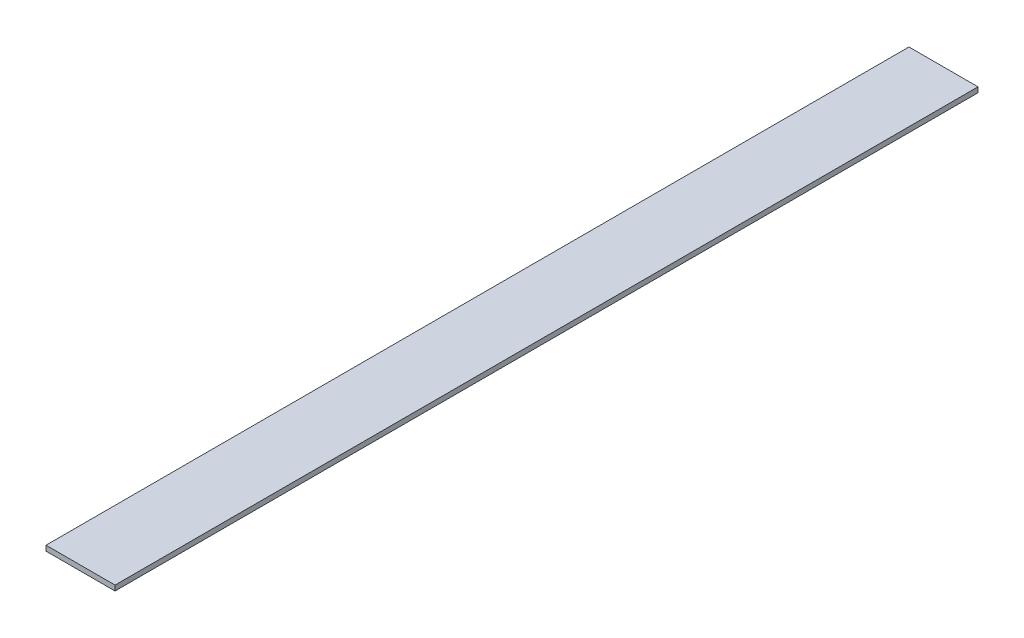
ISO-10303-21;
HEADER;
FILE_DESCRIPTION(('STEP AP214'),'2;1');
FILE_NAME('part.step','',(''),(''),'','','');
FILE_SCHEMA(('AUTOMOTIVE_DESIGN { 1 0 10303 214 1 1 1 1 }'));
ENDSEC;
DATA;
#1=APPLICATION_CONTEXT('core data for automotive mechanical design processes');
#2=APPLICATION_PROTOCOL_DEFINITION('international standard','automotive_design',2000,#1);
#3=PRODUCT_CONTEXT('',#1,'mechanical');
#4=PRODUCT('Part','Part','',(#3));
#5=PRODUCT_RELATED_PRODUCT_CATEGORY('part','',(#4));
#6=PRODUCT_DEFINITION_FORMATION('','',#4);
#7=PRODUCT_DEFINITION_CONTEXT('part definition',#1,'design');
#8=PRODUCT_DEFINITION('design','',#6,#7);
#9=PRODUCT_DEFINITION_SHAPE('','',#8);
#10=(LENGTH_UNIT() NAMED_UNIT(*) SI_UNIT(.MILLI.,.METRE.));
#11=(NAMED_UNIT(*) PLANE_ANGLE_UNIT() SI_UNIT($,.RADIAN.));
#12=(NAMED_UNIT(*) SI_UNIT($,.STERADIAN.) SOLID_ANGLE_UNIT());
#13=UNCERTAINTY_MEASURE_WITH_UNIT(LENGTH_MEASURE(1.E-05),#10,'distance_accuracy_value','');
#14=(GEOMETRIC_REPRESENTATION_CONTEXT(3) GLOBAL_UNCERTAINTY_ASSIGNED_CONTEXT((#13)) GLOBAL_UNIT_ASSIGNED_CONTEXT((#10,
#11,#12)) REPRESENTATION_CONTEXT('',''));
#15=CARTESIAN_POINT('',(0.,0.,0.));
#16=DIRECTION('',(0.,0.,1.));
#17=DIRECTION('',(1.,0.,0.));
#18=AXIS2_PLACEMENT_3D('',#15,#16,#17);
#19=CARTESIAN_POINT('',(-20.,3.,1900.));
#20=DIRECTION('',(1.,0.,0.));
#21=DIRECTION('',(0.,0.,-1.));
#22=AXIS2_PLACEMENT_3D('',#19,#20,#21);
#23=PLANE('',#22);
#24=DIRECTION('',(0.,-1.,0.));
#25=VECTOR('',#24,1.);
#26=CARTESIAN_POINT('',(-20.,3.,500.));
#27=LINE('',#26,#25);
#28=CARTESIAN_POINT('',(-20.,3.,500.));
#29=VERTEX_POINT('',#28);
#30=CARTESIAN_POINT('',(-20.,0.,500.));
#31=VERTEX_POINT('',#30);
#32=EDGE_CURVE('E54',#29,#31,#27,.T.);
#33=ORIENTED_EDGE('',*,*,#32,.F.);
#34=DIRECTION('',(0.,0.,-1.));
#35=VECTOR('',#34,1.);
#36=CARTESIAN_POINT('',(-20.,3.,1900.));
#37=LINE('',#36,#35);
#38=CARTESIAN_POINT('',(-20.,3.,0.));
#39=VERTEX_POINT('',#38);
#40=EDGE_CURVE('E36',#29,#39,#37,.T.);
#41=ORIENTED_EDGE('',*,*,#40,.T.);
#42=DIRECTION('',(0.,-1.,0.));
#43=VECTOR('',#42,1.);
#44=CARTESIAN_POINT('',(-20.,3.,0.));
#45=LINE('',#44,#43);
#46=CARTESIAN_POINT('',(-20.,0.,0.));
#47=VERTEX_POINT('',#46);
#48=EDGE_CURVE('E83',#39,#47,#45,.T.);
#49=ORIENTED_EDGE('',*,*,#48,.T.);
#50=DIRECTION('',(0.,0.,-1.));
#51=VECTOR('',#50,1.);
#52=CARTESIAN_POINT('',(-20.,0.,1900.));
#53=LINE('',#52,#51);
#54=EDGE_CURVE('E9',#31,#47,#53,.T.);
#55=ORIENTED_EDGE('',*,*,#54,.F.);
#56=EDGE_LOOP('',(#33,#41,#49,#55));
#57=FACE_BOUND('',#56,.T.);
#58=ADVANCED_FACE('F14',(#57),#23,.F.);
#59=CARTESIAN_POINT('',(-20.,0.,1900.));
#60=DIRECTION('',(0.,1.,0.));
#61=DIRECTION('',(-1.,0.,0.));
#62=AXIS2_PLACEMENT_3D('',#59,#60,#61);
#63=PLANE('',#62);
#64=DIRECTION('',(1.,0.,0.));
#65=VECTOR('',#64,1.);
#66=CARTESIAN_POINT('',(-20.,0.,500.));
#67=LINE('',#66,#65);
#68=CARTESIAN_POINT('',(20.,0.,500.));
#69=VERTEX_POINT('',#68);
#70=EDGE_CURVE('E60',#31,#69,#67,.T.);
#71=ORIENTED_EDGE('',*,*,#70,.F.);
#72=ORIENTED_EDGE('',*,*,#54,.T.);
#73=DIRECTION('',(1.,0.,0.));
#74=VECTOR('',#73,1.);
#75=CARTESIAN_POINT('',(-20.,0.,0.));
#76=LINE('',#75,#74);
#77=CARTESIAN_POINT('',(20.,0.,0.));
#78=VERTEX_POINT('',#77);
#79=EDGE_CURVE('E80',#47,#78,#76,.T.);
#80=ORIENTED_EDGE('',*,*,#79,.T.);
#81=DIRECTION('',(0.,0.,-1.));
#82=VECTOR('',#81,1.);
#83=CARTESIAN_POINT('',(20.,0.,1900.));
#84=LINE('',#83,#82);
#85=EDGE_CURVE('E21',#69,#78,#84,.T.);
#86=ORIENTED_EDGE('',*,*,#85,.F.);
#87=EDGE_LOOP('',(#71,#72,#80,#86));
#88=FACE_BOUND('',#87,.T.);
#89=ADVANCED_FACE('F81',(#88),#63,.F.);
#90=CARTESIAN_POINT('',(20.,3.,1900.));
#91=DIRECTION('',(-1.,0.,0.));
#92=DIRECTION('',(0.,0.,1.));
#93=AXIS2_PLACEMENT_3D('',#90,#91,#92);
#94=PLANE('',#93);
#95=DIRECTION('',(0.,1.,0.));
#96=VECTOR('',#95,1.);
#97=CARTESIAN_POINT('',(20.,0.,500.));
#98=LINE('',#97,#96);
#99=CARTESIAN_POINT('',(20.,3.,500.));
#100=VERTEX_POINT('',#99);
#101=EDGE_CURVE('E28',#69,#100,#98,.T.);
#102=ORIENTED_EDGE('',*,*,#101,.F.);
#103=ORIENTED_EDGE('',*,*,#85,.T.);
#104=DIRECTION('',(0.,1.,0.));
#105=VECTOR('',#104,1.);
#106=CARTESIAN_POINT('',(20.,3.,0.));
#107=LINE('',#106,#105);
#108=CARTESIAN_POINT('',(20.,3.,0.));
#109=VERTEX_POINT('',#108);
#110=EDGE_CURVE('E69',#78,#109,#107,.T.);
#111=ORIENTED_EDGE('',*,*,#110,.T.);
#112=DIRECTION('',(0.,0.,-1.));
#113=VECTOR('',#112,1.);
#114=CARTESIAN_POINT('',(20.,3.,1900.));
#115=LINE('',#114,#113);
#116=EDGE_CURVE('E66',#100,#109,#115,.T.);
#117=ORIENTED_EDGE('',*,*,#116,.F.);
#118=EDGE_LOOP('',(#102,#103,#111,#117));
#119=FACE_BOUND('',#118,.T.);
#120=ADVANCED_FACE('F76',(#119),#94,.F.);
#121=CARTESIAN_POINT('',(-20.,3.,1900.));
#122=DIRECTION('',(0.,-1.,0.));
#123=DIRECTION('',(0.,0.,-1.));
#124=AXIS2_PLACEMENT_3D('',#121,#122,#123);
#125=PLANE('',#124);
#126=DIRECTION('',(-1.,0.,0.));
#127=VECTOR('',#126,1.);
#128=CARTESIAN_POINT('',(20.,3.,500.));
#129=LINE('',#128,#127);
#130=EDGE_CURVE('E52',#100,#29,#129,.T.);
#131=ORIENTED_EDGE('',*,*,#130,.F.);
#132=ORIENTED_EDGE('',*,*,#116,.T.);
#133=DIRECTION('',(-1.,0.,0.));
#134=VECTOR('',#133,1.);
#135=CARTESIAN_POINT('',(-20.,3.,0.));
#136=LINE('',#135,#134);
#137=EDGE_CURVE('E64',#109,#39,#136,.T.);
#138=ORIENTED_EDGE('',*,*,#137,.T.);
#139=ORIENTED_EDGE('',*,*,#40,.F.);
#140=EDGE_LOOP('',(#131,#132,#138,#139));
#141=FACE_BOUND('',#140,.T.);
#142=ADVANCED_FACE('F62',(#141),#125,.F.);
#143=CARTESIAN_POINT('',(-20.,3.,0.));
#144=DIRECTION('',(0.,0.,1.));
#145=DIRECTION('',(1.,0.,0.));
#146=AXIS2_PLACEMENT_3D('',#143,#144,#145);
#147=PLANE('',#146);
#148=ORIENTED_EDGE('',*,*,#48,.F.);
#149=ORIENTED_EDGE('',*,*,#137,.F.);
#150=ORIENTED_EDGE('',*,*,#110,.F.);
#151=ORIENTED_EDGE('',*,*,#79,.F.);
#152=EDGE_LOOP('',(#148,#149,#150,#151));
#153=FACE_BOUND('',#152,.T.);
#154=ADVANCED_FACE('F85',(#153),#147,.F.);
#155=CARTESIAN_POINT('',(-20.,3.,500.));
#156=DIRECTION('',(0.,0.,1.));
#157=DIRECTION('',(1.,0.,0.));
#158=AXIS2_PLACEMENT_3D('',#155,#156,#157);
#159=PLANE('',#158);
#160=ORIENTED_EDGE('',*,*,#130,.T.);
#161=ORIENTED_EDGE('',*,*,#32,.T.);
#162=ORIENTED_EDGE('',*,*,#70,.T.);
#163=ORIENTED_EDGE('',*,*,#101,.T.);
#164=EDGE_LOOP('',(#160,#161,#162,#163));
#165=FACE_BOUND('',#164,.T.);
#166=ADVANCED_FACE('F53',(#165),#159,.T.);
#167=CLOSED_SHELL('',(#58,#89,#120,#142,#154,#166));
#168=MANIFOLD_SOLID_BREP('B1',#167);
#169=ADVANCED_BREP_SHAPE_REPRESENTATION('',(#18,#168),#14);
#170=SHAPE_DEFINITION_REPRESENTATION(#9,#169);
ENDSEC;
END-ISO-10303-21;
